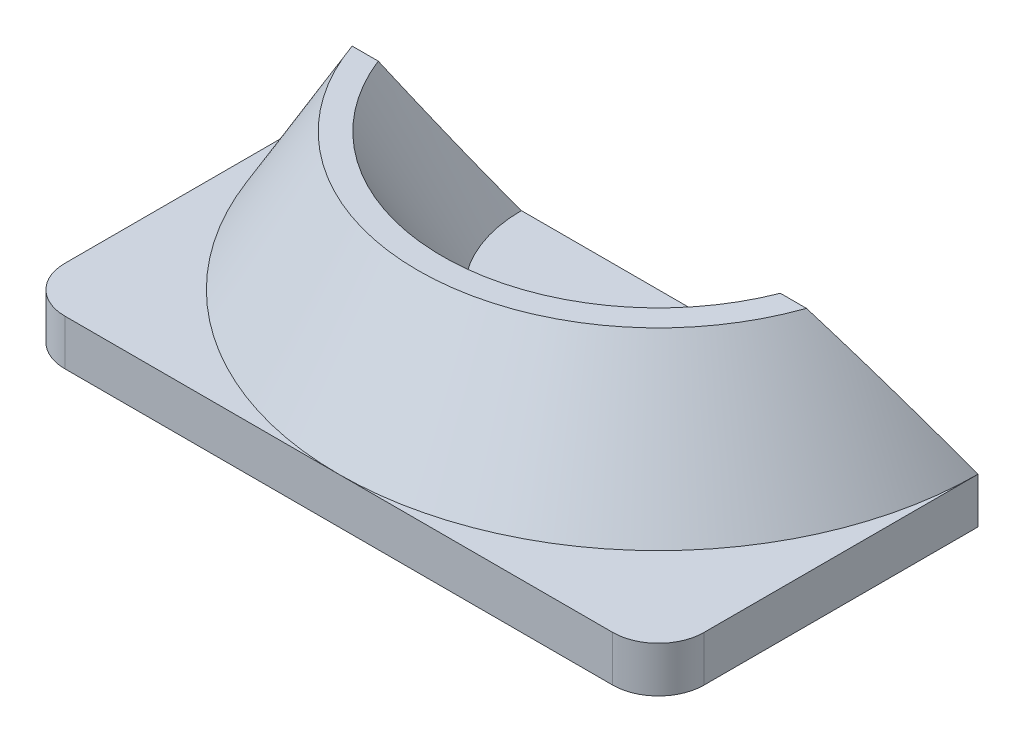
ISO-10303-21;
HEADER;
FILE_DESCRIPTION(('STEP AP214'),'2;1');
FILE_NAME('part.step','',(''),(''),'','','');
FILE_SCHEMA(('AUTOMOTIVE_DESIGN { 1 0 10303 214 1 1 1 1 }'));
ENDSEC;
DATA;
#1=APPLICATION_CONTEXT('core data for automotive mechanical design processes');
#2=APPLICATION_PROTOCOL_DEFINITION('international standard','automotive_design',2000,#1);
#3=PRODUCT_CONTEXT('',#1,'mechanical');
#4=PRODUCT('Part','Part','',(#3));
#5=PRODUCT_RELATED_PRODUCT_CATEGORY('part','',(#4));
#6=PRODUCT_DEFINITION_FORMATION('','',#4);
#7=PRODUCT_DEFINITION_CONTEXT('part definition',#1,'design');
#8=PRODUCT_DEFINITION('design','',#6,#7);
#9=PRODUCT_DEFINITION_SHAPE('','',#8);
#10=(LENGTH_UNIT() NAMED_UNIT(*) SI_UNIT(.MILLI.,.METRE.));
#11=(NAMED_UNIT(*) PLANE_ANGLE_UNIT() SI_UNIT($,.RADIAN.));
#12=(NAMED_UNIT(*) SI_UNIT($,.STERADIAN.) SOLID_ANGLE_UNIT());
#13=UNCERTAINTY_MEASURE_WITH_UNIT(LENGTH_MEASURE(1.E-05),#10,'distance_accuracy_value','');
#14=(GEOMETRIC_REPRESENTATION_CONTEXT(3) GLOBAL_UNCERTAINTY_ASSIGNED_CONTEXT((#13)) GLOBAL_UNIT_ASSIGNED_CONTEXT((#10,
#11,#12)) REPRESENTATION_CONTEXT('',''));
#15=CARTESIAN_POINT('',(0.,0.,0.));
#16=DIRECTION('',(0.,0.,1.));
#17=DIRECTION('',(1.,0.,0.));
#18=AXIS2_PLACEMENT_3D('',#15,#16,#17);
#19=CARTESIAN_POINT('',(-30.,5.,30.));
#20=DIRECTION('',(0.,1.,0.));
#21=DIRECTION('',(0.,0.,1.));
#22=AXIS2_PLACEMENT_3D('',#19,#20,#21);
#23=PLANE('',#22);
#24=CARTESIAN_POINT('',(0.,5.,0.));
#25=DIRECTION('',(0.,1.,0.));
#26=DIRECTION('',(0.,0.,1.));
#27=AXIS2_PLACEMENT_3D('',#24,#25,#26);
#28=CIRCLE('',#27,35.);
#29=CARTESIAN_POINT('',(-35.,5.,0.));
#30=VERTEX_POINT('',#29);
#31=CARTESIAN_POINT('',(0.,5.,35.));
#32=VERTEX_POINT('',#31);
#33=EDGE_CURVE('E49',#30,#32,#28,.T.);
#34=ORIENTED_EDGE('',*,*,#33,.F.);
#35=DIRECTION('',(0.,0.,1.));
#36=VECTOR('',#35,1.);
#37=CARTESIAN_POINT('',(-35.,5.,30.));
#38=LINE('',#37,#36);
#39=CARTESIAN_POINT('',(-35.,5.,30.));
#40=VERTEX_POINT('',#39);
#41=EDGE_CURVE('E200',#30,#40,#38,.T.);
#42=ORIENTED_EDGE('',*,*,#41,.T.);
#43=CARTESIAN_POINT('',(-30.,5.,30.));
#44=DIRECTION('',(0.,1.,0.));
#45=DIRECTION('',(0.,0.,1.));
#46=AXIS2_PLACEMENT_3D('',#43,#44,#45);
#47=CIRCLE('',#46,5.);
#48=CARTESIAN_POINT('',(-30.,5.,35.));
#49=VERTEX_POINT('',#48);
#50=EDGE_CURVE('E268',#40,#49,#47,.T.);
#51=ORIENTED_EDGE('',*,*,#50,.T.);
#52=DIRECTION('',(1.,0.,0.));
#53=VECTOR('',#52,1.);
#54=CARTESIAN_POINT('',(-30.,5.,35.));
#55=LINE('',#54,#53);
#56=EDGE_CURVE('E202',#49,#32,#55,.T.);
#57=ORIENTED_EDGE('',*,*,#56,.T.);
#58=EDGE_LOOP('',(#34,#42,#51,#57));
#59=FACE_BOUND('',#58,.T.);
#60=ADVANCED_FACE('F33',(#59),#23,.T.);
#61=CARTESIAN_POINT('',(35.,5.,0.));
#62=VERTEX_POINT('',#61);
#63=EDGE_CURVE('E11',#32,#62,#28,.T.);
#64=ORIENTED_EDGE('',*,*,#63,.F.);
#65=CARTESIAN_POINT('',(30.,5.,35.));
#66=VERTEX_POINT('',#65);
#67=EDGE_CURVE('E270',#32,#66,#55,.T.);
#68=ORIENTED_EDGE('',*,*,#67,.T.);
#69=CARTESIAN_POINT('',(30.,5.,30.));
#70=DIRECTION('',(0.,1.,0.));
#71=DIRECTION('',(0.,0.,1.));
#72=AXIS2_PLACEMENT_3D('',#69,#70,#71);
#73=CIRCLE('',#72,5.);
#74=CARTESIAN_POINT('',(35.,5.,30.));
#75=VERTEX_POINT('',#74);
#76=EDGE_CURVE('E271',#66,#75,#73,.T.);
#77=ORIENTED_EDGE('',*,*,#76,.T.);
#78=DIRECTION('',(0.,0.,-1.));
#79=VECTOR('',#78,1.);
#80=CARTESIAN_POINT('',(35.,5.,30.));
#81=LINE('',#80,#79);
#82=EDGE_CURVE('E117',#75,#62,#81,.T.);
#83=ORIENTED_EDGE('',*,*,#82,.T.);
#84=EDGE_LOOP('',(#64,#68,#77,#83));
#85=FACE_BOUND('',#84,.T.);
#86=ADVANCED_FACE('F172',(#85),#23,.T.);
#87=CARTESIAN_POINT('',(-30.,5.,30.));
#88=DIRECTION('',(0.,-1.,0.));
#89=DIRECTION('',(0.,0.,-1.));
#90=AXIS2_PLACEMENT_3D('',#87,#88,#89);
#91=CYLINDRICAL_SURFACE('',#90,5.);
#92=CARTESIAN_POINT('',(-30.,0.,30.));
#93=DIRECTION('',(0.,1.,0.));
#94=DIRECTION('',(0.,0.,1.));
#95=AXIS2_PLACEMENT_3D('',#92,#93,#94);
#96=CIRCLE('',#95,5.);
#97=CARTESIAN_POINT('',(-35.,0.,30.));
#98=VERTEX_POINT('',#97);
#99=CARTESIAN_POINT('',(-30.,0.,35.));
#100=VERTEX_POINT('',#99);
#101=EDGE_CURVE('E210',#98,#100,#96,.T.);
#102=ORIENTED_EDGE('',*,*,#101,.T.);
#103=DIRECTION('',(0.,-1.,0.));
#104=VECTOR('',#103,1.);
#105=CARTESIAN_POINT('',(-30.,5.,35.));
#106=LINE('',#105,#104);
#107=EDGE_CURVE('E47',#49,#100,#106,.T.);
#108=ORIENTED_EDGE('',*,*,#107,.F.);
#109=ORIENTED_EDGE('',*,*,#50,.F.);
#110=DIRECTION('',(0.,-1.,0.));
#111=VECTOR('',#110,1.);
#112=CARTESIAN_POINT('',(-35.,5.,30.));
#113=LINE('',#112,#111);
#114=EDGE_CURVE('E228',#40,#98,#113,.T.);
#115=ORIENTED_EDGE('',*,*,#114,.T.);
#116=EDGE_LOOP('',(#102,#108,#109,#115));
#117=FACE_BOUND('',#116,.T.);
#118=ADVANCED_FACE('F35',(#117),#91,.T.);
#119=CARTESIAN_POINT('',(-30.,5.,35.));
#120=DIRECTION('',(0.,0.,-1.));
#121=DIRECTION('',(-1.,0.,0.));
#122=AXIS2_PLACEMENT_3D('',#119,#120,#121);
#123=PLANE('',#122);
#124=DIRECTION('',(1.,0.,0.));
#125=VECTOR('',#124,1.);
#126=CARTESIAN_POINT('',(-30.,0.,35.));
#127=LINE('',#126,#125);
#128=CARTESIAN_POINT('',(30.,0.,35.));
#129=VERTEX_POINT('',#128);
#130=EDGE_CURVE('E251',#100,#129,#127,.T.);
#131=ORIENTED_EDGE('',*,*,#130,.T.);
#132=DIRECTION('',(0.,-1.,0.));
#133=VECTOR('',#132,1.);
#134=CARTESIAN_POINT('',(30.,5.,35.));
#135=LINE('',#134,#133);
#136=EDGE_CURVE('E245',#66,#129,#135,.T.);
#137=ORIENTED_EDGE('',*,*,#136,.F.);
#138=ORIENTED_EDGE('',*,*,#67,.F.);
#139=ORIENTED_EDGE('',*,*,#56,.F.);
#140=ORIENTED_EDGE('',*,*,#107,.T.);
#141=EDGE_LOOP('',(#131,#137,#138,#139,#140));
#142=FACE_BOUND('',#141,.T.);
#143=ADVANCED_FACE('F184',(#142),#123,.F.);
#144=CARTESIAN_POINT('',(30.,5.,30.));
#145=DIRECTION('',(0.,-1.,0.));
#146=DIRECTION('',(0.,0.,-1.));
#147=AXIS2_PLACEMENT_3D('',#144,#145,#146);
#148=CYLINDRICAL_SURFACE('',#147,5.);
#149=CARTESIAN_POINT('',(30.,0.,30.));
#150=DIRECTION('',(0.,1.,0.));
#151=DIRECTION('',(0.,0.,1.));
#152=AXIS2_PLACEMENT_3D('',#149,#150,#151);
#153=CIRCLE('',#152,5.);
#154=CARTESIAN_POINT('',(35.,0.,30.));
#155=VERTEX_POINT('',#154);
#156=EDGE_CURVE('E256',#129,#155,#153,.T.);
#157=ORIENTED_EDGE('',*,*,#156,.T.);
#158=DIRECTION('',(0.,-1.,0.));
#159=VECTOR('',#158,1.);
#160=CARTESIAN_POINT('',(35.,5.,30.));
#161=LINE('',#160,#159);
#162=EDGE_CURVE('E242',#75,#155,#161,.T.);
#163=ORIENTED_EDGE('',*,*,#162,.F.);
#164=ORIENTED_EDGE('',*,*,#76,.F.);
#165=ORIENTED_EDGE('',*,*,#136,.T.);
#166=EDGE_LOOP('',(#157,#163,#164,#165));
#167=FACE_BOUND('',#166,.T.);
#168=ADVANCED_FACE('F181',(#167),#148,.T.);
#169=CARTESIAN_POINT('',(35.,5.,30.));
#170=DIRECTION('',(-1.,0.,0.));
#171=DIRECTION('',(0.,0.,1.));
#172=AXIS2_PLACEMENT_3D('',#169,#170,#171);
#173=PLANE('',#172);
#174=DIRECTION('',(0.,0.,-1.));
#175=VECTOR('',#174,1.);
#176=CARTESIAN_POINT('',(35.,0.,30.));
#177=LINE('',#176,#175);
#178=CARTESIAN_POINT('',(35.,0.,0.));
#179=VERTEX_POINT('',#178);
#180=EDGE_CURVE('E262',#155,#179,#177,.T.);
#181=ORIENTED_EDGE('',*,*,#180,.T.);
#182=DIRECTION('',(0.,-1.,0.));
#183=VECTOR('',#182,1.);
#184=CARTESIAN_POINT('',(35.,5.,0.));
#185=LINE('',#184,#183);
#186=EDGE_CURVE('E240',#62,#179,#185,.T.);
#187=ORIENTED_EDGE('',*,*,#186,.F.);
#188=ORIENTED_EDGE('',*,*,#82,.F.);
#189=ORIENTED_EDGE('',*,*,#162,.T.);
#190=EDGE_LOOP('',(#181,#187,#188,#189));
#191=FACE_BOUND('',#190,.T.);
#192=ADVANCED_FACE('F178',(#191),#173,.F.);
#193=CARTESIAN_POINT('',(-35.,5.,0.));
#194=DIRECTION('',(0.,0.,1.));
#195=DIRECTION('',(1.,0.,0.));
#196=AXIS2_PLACEMENT_3D('',#193,#194,#195);
#197=PLANE('',#196);
#198=DIRECTION('',(-1.,0.,0.));
#199=VECTOR('',#198,1.);
#200=CARTESIAN_POINT('',(-35.,0.,0.));
#201=LINE('',#200,#199);
#202=CARTESIAN_POINT('',(-35.,0.,0.));
#203=VERTEX_POINT('',#202);
#204=EDGE_CURVE('E264',#179,#203,#201,.T.);
#205=ORIENTED_EDGE('',*,*,#204,.T.);
#206=DIRECTION('',(0.,-1.,0.));
#207=VECTOR('',#206,1.);
#208=CARTESIAN_POINT('',(-35.,5.,0.));
#209=LINE('',#208,#207);
#210=EDGE_CURVE('E124',#30,#203,#209,.T.);
#211=ORIENTED_EDGE('',*,*,#210,.F.);
#212=DIRECTION('',(-1.,0.,0.));
#213=VECTOR('',#212,1.);
#214=CARTESIAN_POINT('',(-35.,5.,0.));
#215=LINE('',#214,#213);
#216=CARTESIAN_POINT('',(-15.,5.,0.));
#217=VERTEX_POINT('',#216);
#218=EDGE_CURVE('E121',#217,#30,#215,.T.);
#219=ORIENTED_EDGE('',*,*,#218,.F.);
#220=DIRECTION('',(-1.,0.,0.));
#221=VECTOR('',#220,1.);
#222=CARTESIAN_POINT('',(-35.,5.,0.));
#223=LINE('',#222,#221);
#224=CARTESIAN_POINT('',(15.,5.,0.));
#225=VERTEX_POINT('',#224);
#226=EDGE_CURVE('E110',#225,#217,#223,.T.);
#227=ORIENTED_EDGE('',*,*,#226,.F.);
#228=EDGE_CURVE('E116',#62,#225,#223,.T.);
#229=ORIENTED_EDGE('',*,*,#228,.F.);
#230=ORIENTED_EDGE('',*,*,#186,.T.);
#231=EDGE_LOOP('',(#205,#211,#219,#227,#229,#230));
#232=FACE_BOUND('',#231,.T.);
#233=ADVANCED_FACE('F122',(#232),#197,.F.);
#234=CARTESIAN_POINT('',(-35.,5.,30.));
#235=DIRECTION('',(1.,0.,0.));
#236=DIRECTION('',(0.,0.,-1.));
#237=AXIS2_PLACEMENT_3D('',#234,#235,#236);
#238=PLANE('',#237);
#239=DIRECTION('',(0.,0.,1.));
#240=VECTOR('',#239,1.);
#241=CARTESIAN_POINT('',(-35.,0.,30.));
#242=LINE('',#241,#240);
#243=EDGE_CURVE('E266',#203,#98,#242,.T.);
#244=ORIENTED_EDGE('',*,*,#243,.T.);
#245=ORIENTED_EDGE('',*,*,#114,.F.);
#246=ORIENTED_EDGE('',*,*,#41,.F.);
#247=ORIENTED_EDGE('',*,*,#210,.T.);
#248=EDGE_LOOP('',(#244,#245,#246,#247));
#249=FACE_BOUND('',#248,.T.);
#250=ADVANCED_FACE('F171',(#249),#238,.F.);
#251=CARTESIAN_POINT('',(0.,5.,0.));
#252=DIRECTION('',(0.,-1.,0.));
#253=DIRECTION('',(0.,0.,1.));
#254=AXIS2_PLACEMENT_3D('',#251,#252,#253);
#255=CIRCLE('',#254,15.);
#256=EDGE_CURVE('E55',#225,#217,#255,.T.);
#257=ORIENTED_EDGE('',*,*,#256,.F.);
#258=ORIENTED_EDGE('',*,*,#226,.T.);
#259=EDGE_LOOP('',(#257,#258));
#260=FACE_BOUND('',#259,.T.);
#261=ADVANCED_FACE('F112',(#260),#23,.T.);
#262=CARTESIAN_POINT('',(-30.,0.,30.));
#263=DIRECTION('',(0.,1.,0.));
#264=DIRECTION('',(0.,0.,1.));
#265=AXIS2_PLACEMENT_3D('',#262,#263,#264);
#266=PLANE('',#265);
#267=ORIENTED_EDGE('',*,*,#101,.F.);
#268=ORIENTED_EDGE('',*,*,#243,.F.);
#269=ORIENTED_EDGE('',*,*,#204,.F.);
#270=ORIENTED_EDGE('',*,*,#180,.F.);
#271=ORIENTED_EDGE('',*,*,#156,.F.);
#272=ORIENTED_EDGE('',*,*,#130,.F.);
#273=EDGE_LOOP('',(#267,#268,#269,#270,#271,#272));
#274=FACE_BOUND('',#273,.T.);
#275=ADVANCED_FACE('F163',(#274),#266,.F.);
#276=CARTESIAN_POINT('',(0.,5.,0.));
#277=DIRECTION('',(0.,-1.,0.));
#278=DIRECTION('',(0.,0.,1.));
#279=AXIS2_PLACEMENT_3D('',#276,#277,#278);
#280=CONICAL_SURFACE('',#279,35.,0.5235987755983);
#281=ORIENTED_EDGE('',*,*,#33,.T.);
#282=ORIENTED_EDGE('',*,*,#63,.T.);
#283=CARTESIAN_POINT('',(24.875333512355,20.,8.66025403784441));
#284=CARTESIAN_POINT('',(25.1163008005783,19.703361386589,8.48898965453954));
#285=CARTESIAN_POINT('',(25.3549277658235,19.4053051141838,8.31690678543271));
#286=CARTESIAN_POINT('',(25.8277115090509,18.8065541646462,7.97121776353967));
#287=CARTESIAN_POINT('',(26.0618683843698,18.5058595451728,7.79761164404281));
#288=CARTESIAN_POINT('',(26.7579013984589,17.6001769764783,7.27471556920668));
#289=CARTESIAN_POINT('',(27.2134060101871,16.9915087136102,6.92330078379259));
#290=CARTESIAN_POINT('',(28.1082994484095,15.7665118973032,6.2160485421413));
#291=CARTESIAN_POINT('',(28.5477089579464,15.1501946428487,5.86021760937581));
#292=CARTESIAN_POINT('',(29.4123770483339,13.9101390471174,5.14427117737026));
#293=CARTESIAN_POINT('',(29.837635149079,13.2864004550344,4.78415553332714));
#294=CARTESIAN_POINT('',(30.6749063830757,12.032751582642,4.06036101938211));
#295=CARTESIAN_POINT('',(31.0869265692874,11.4028448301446,3.69668418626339));
#296=CARTESIAN_POINT('',(31.8989753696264,10.1372672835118,2.96600264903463));
#297=CARTESIAN_POINT('',(32.2990039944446,9.50159649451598,2.59899794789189));
#298=CARTESIAN_POINT('',(33.0885099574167,8.22425349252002,1.86152362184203));
#299=CARTESIAN_POINT('',(33.4779721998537,7.58257429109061,1.49104996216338));
#300=CARTESIAN_POINT('',(34.2465474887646,6.29461442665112,0.747445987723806));
#301=CARTESIAN_POINT('',(34.6256609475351,5.64833394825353,0.374315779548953));
#302=CARTESIAN_POINT('',(35.,5.,0.));
#303=B_SPLINE_CURVE_WITH_KNOTS('',3,(#283,#284,#285,#286,#287,#288,#289,#290,#291,#292,#293,
#294,#295,#296,#297,#298,#299,#300,#301,#302),.UNSPECIFIED.,.F.,.F.,(4,2,2,2,2,2,2,2,2,4),(0.,
1.25636911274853,2.51271083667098,5.02504910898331,7.53403673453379,10.0431093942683,
12.5508223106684,15.0585329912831,17.5696554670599,20.0806777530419),.UNSPECIFIED.);
#304=CARTESIAN_POINT('',(24.875333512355,20.,8.66025403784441));
#305=VERTEX_POINT('',#304);
#306=EDGE_CURVE('E146',#305,#62,#303,.T.);
#307=ORIENTED_EDGE('',*,*,#306,.F.);
#308=CARTESIAN_POINT('',(0.,20.,0.));
#309=DIRECTION('',(0.,1.,0.));
#310=DIRECTION('',(0.,0.,1.));
#311=AXIS2_PLACEMENT_3D('',#308,#309,#310);
#312=CIRCLE('',#311,26.3397459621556);
#313=CARTESIAN_POINT('',(-24.875333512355,20.,8.66025403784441));
#314=VERTEX_POINT('',#313);
#315=EDGE_CURVE('E130',#314,#305,#312,.T.);
#316=ORIENTED_EDGE('',*,*,#315,.F.);
#317=CARTESIAN_POINT('',(-24.875333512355,20.,8.66025403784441));
#318=CARTESIAN_POINT('',(-25.1163008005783,19.703361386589,8.48898965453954));
#319=CARTESIAN_POINT('',(-25.3549277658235,19.4053051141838,8.3169067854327));
#320=CARTESIAN_POINT('',(-25.8277115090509,18.8065541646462,7.97121776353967));
#321=CARTESIAN_POINT('',(-26.0618683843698,18.5058595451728,7.79761164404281));
#322=CARTESIAN_POINT('',(-26.7579013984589,17.6001769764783,7.27471556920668));
#323=CARTESIAN_POINT('',(-27.2134060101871,16.9915087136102,6.92330078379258));
#324=CARTESIAN_POINT('',(-28.1082994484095,15.7665118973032,6.2160485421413));
#325=CARTESIAN_POINT('',(-28.5477089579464,15.1501946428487,5.86021760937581));
#326=CARTESIAN_POINT('',(-29.4123770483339,13.9101390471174,5.14427117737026));
#327=CARTESIAN_POINT('',(-29.837635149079,13.2864004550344,4.78415553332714));
#328=CARTESIAN_POINT('',(-30.6749063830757,12.032751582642,4.06036101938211));
#329=CARTESIAN_POINT('',(-31.0869265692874,11.4028448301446,3.69668418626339));
#330=CARTESIAN_POINT('',(-31.8989753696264,10.1372672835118,2.96600264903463));
#331=CARTESIAN_POINT('',(-32.2990039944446,9.50159649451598,2.59899794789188));
#332=CARTESIAN_POINT('',(-33.0885099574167,8.22425349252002,1.86152362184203));
#333=CARTESIAN_POINT('',(-33.4779721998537,7.58257429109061,1.49104996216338));
#334=CARTESIAN_POINT('',(-34.2465474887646,6.29461442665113,0.747445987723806));
#335=CARTESIAN_POINT('',(-34.6256609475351,5.64833394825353,0.374315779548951));
#336=CARTESIAN_POINT('',(-35.,5.,0.));
#337=B_SPLINE_CURVE_WITH_KNOTS('',3,(#317,#318,#319,#320,#321,#322,#323,#324,#325,#326,#327,
#328,#329,#330,#331,#332,#333,#334,#335,#336),.UNSPECIFIED.,.F.,.F.,(4,2,2,2,2,2,2,2,2,4),(0.,
1.25636911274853,2.51271083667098,5.02504910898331,7.53403673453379,10.0431093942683,
12.5508223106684,15.0585329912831,17.5696554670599,20.0806777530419),.UNSPECIFIED.);
#338=EDGE_CURVE('E144',#314,#30,#337,.T.);
#339=ORIENTED_EDGE('',*,*,#338,.T.);
#340=EDGE_LOOP('',(#281,#282,#307,#316,#339));
#341=FACE_BOUND('',#340,.T.);
#342=ADVANCED_FACE('F167',(#341),#280,.T.);
#343=CARTESIAN_POINT('',(35.,5.,0.));
#344=DIRECTION('',(0.,0.500000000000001,-0.866025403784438));
#345=DIRECTION('',(0.,0.866025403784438,0.500000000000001));
#346=AXIS2_PLACEMENT_3D('',#343,#344,#345);
#347=PLANE('',#346);
#348=ORIENTED_EDGE('',*,*,#228,.T.);
#349=CARTESIAN_POINT('',(22.0183473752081,20.,8.66025403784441));
#350=CARTESIAN_POINT('',(21.7670216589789,19.3610803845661,8.29137362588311));
#351=CARTESIAN_POINT('',(21.5118821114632,18.7232756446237,7.92313688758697));
#352=CARTESIAN_POINT('',(20.9931402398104,17.4502326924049,7.18814519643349));
#353=CARTESIAN_POINT('',(20.7295376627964,16.8149945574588,6.82139028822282));
#354=CARTESIAN_POINT('',(20.1933411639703,15.5481488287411,6.08997656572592));
#355=CARTESIAN_POINT('',(19.9207573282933,14.9165380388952,5.72531590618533));
#356=CARTESIAN_POINT('',(19.3653207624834,13.6567026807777,4.99794962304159));
#357=CARTESIAN_POINT('',(19.0824679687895,13.0284781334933,4.63524401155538));
#358=CARTESIAN_POINT('',(18.5051268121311,11.7755703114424,3.9118773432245));
#359=CARTESIAN_POINT('',(18.2106310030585,11.1508896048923,3.55121776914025));
#360=CARTESIAN_POINT('',(17.6087694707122,9.90621820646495,2.83260640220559));
#361=CARTESIAN_POINT('',(17.3014042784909,9.28622732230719,2.47465449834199));
#362=CARTESIAN_POINT('',(16.6717334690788,8.05114658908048,1.76158030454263));
#363=CARTESIAN_POINT('',(16.3494122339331,7.43606268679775,1.40646144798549));
#364=CARTESIAN_POINT('',(15.8533399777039,6.51849342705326,0.876702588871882));
#365=CARTESIAN_POINT('',(15.6858706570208,6.2134562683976,0.700589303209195));
#366=CARTESIAN_POINT('',(15.3464088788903,5.60526558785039,0.349450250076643));
#367=CARTESIAN_POINT('',(15.1744162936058,5.30211211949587,0.174424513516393));
#368=CARTESIAN_POINT('',(15.,5.,0.));
#369=B_SPLINE_CURVE_WITH_KNOTS('',3,(#349,#350,#351,#352,#353,#354,#355,#356,#357,#358,#359,
#360,#361,#362,#363,#364,#365,#366,#367,#368),.UNSPECIFIED.,.F.,.F.,(4,2,2,2,2,2,2,2,2,4),(0.,
2.33818948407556,4.6764488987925,7.01216636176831,9.3478982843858,11.685148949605,
14.0223032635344,16.3619556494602,17.5319636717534,18.7020047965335),.UNSPECIFIED.);
#370=CARTESIAN_POINT('',(22.0183473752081,20.,8.66025403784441));
#371=VERTEX_POINT('',#370);
#372=EDGE_CURVE('E140',#371,#225,#369,.T.);
#373=ORIENTED_EDGE('',*,*,#372,.F.);
#374=DIRECTION('',(1.,0.,0.));
#375=VECTOR('',#374,1.);
#376=CARTESIAN_POINT('',(35.,20.,8.66025403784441));
#377=LINE('',#376,#375);
#378=EDGE_CURVE('E281',#305,#371,#377,.F.);
#379=ORIENTED_EDGE('',*,*,#378,.F.);
#380=ORIENTED_EDGE('',*,*,#306,.T.);
#381=EDGE_LOOP('',(#348,#373,#379,#380));
#382=FACE_BOUND('',#381,.T.);
#383=ADVANCED_FACE('F162',(#382),#347,.T.);
#384=CARTESIAN_POINT('',(0.,5.,0.));
#385=DIRECTION('',(0.,1.,0.));
#386=DIRECTION('',(0.,0.,1.));
#387=AXIS2_PLACEMENT_3D('',#384,#385,#386);
#388=CONICAL_SURFACE('',#387,15.,0.5235987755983);
#389=ORIENTED_EDGE('',*,*,#256,.T.);
#390=CARTESIAN_POINT('',(-22.0183473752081,20.,8.66025403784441));
#391=CARTESIAN_POINT('',(-21.7670216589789,19.3610803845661,8.29137362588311));
#392=CARTESIAN_POINT('',(-21.5118821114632,18.7232756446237,7.92313688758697));
#393=CARTESIAN_POINT('',(-20.9931402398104,17.4502326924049,7.18814519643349));
#394=CARTESIAN_POINT('',(-20.7295376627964,16.8149945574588,6.82139028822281));
#395=CARTESIAN_POINT('',(-20.1933411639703,15.5481488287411,6.08997656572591));
#396=CARTESIAN_POINT('',(-19.9207573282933,14.9165380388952,5.72531590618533));
#397=CARTESIAN_POINT('',(-19.3653207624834,13.6567026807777,4.99794962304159));
#398=CARTESIAN_POINT('',(-19.0824679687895,13.0284781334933,4.63524401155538));
#399=CARTESIAN_POINT('',(-18.5051268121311,11.7755703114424,3.9118773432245));
#400=CARTESIAN_POINT('',(-18.2106310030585,11.1508896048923,3.55121776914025));
#401=CARTESIAN_POINT('',(-17.6087694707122,9.90621820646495,2.83260640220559));
#402=CARTESIAN_POINT('',(-17.3014042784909,9.28622732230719,2.47465449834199));
#403=CARTESIAN_POINT('',(-16.6717334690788,8.05114658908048,1.76158030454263));
#404=CARTESIAN_POINT('',(-16.3494122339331,7.43606268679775,1.40646144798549));
#405=CARTESIAN_POINT('',(-15.8533399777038,6.51849342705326,0.876702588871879));
#406=CARTESIAN_POINT('',(-15.6858706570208,6.21345626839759,0.700589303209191));
#407=CARTESIAN_POINT('',(-15.3464088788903,5.60526558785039,0.34945025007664));
#408=CARTESIAN_POINT('',(-15.1744162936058,5.30211211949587,0.174424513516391));
#409=CARTESIAN_POINT('',(-15.,5.,0.));
#410=B_SPLINE_CURVE_WITH_KNOTS('',3,(#390,#391,#392,#393,#394,#395,#396,#397,#398,#399,#400,
#401,#402,#403,#404,#405,#406,#407,#408,#409),.UNSPECIFIED.,.F.,.F.,(4,2,2,2,2,2,2,2,2,4),(0.,
2.33818948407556,4.6764488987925,7.0121663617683,9.3478982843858,11.685148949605,
14.0223032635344,16.3619556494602,17.5319636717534,18.7020047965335),.UNSPECIFIED.);
#411=CARTESIAN_POINT('',(-22.0183473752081,20.,8.66025403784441));
#412=VERTEX_POINT('',#411);
#413=EDGE_CURVE('E137',#412,#217,#410,.T.);
#414=ORIENTED_EDGE('',*,*,#413,.F.);
#415=CARTESIAN_POINT('',(0.,20.,0.));
#416=DIRECTION('',(0.,1.,0.));
#417=DIRECTION('',(0.,0.,1.));
#418=AXIS2_PLACEMENT_3D('',#415,#416,#417);
#419=CIRCLE('',#418,23.6602540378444);
#420=EDGE_CURVE('E279',#371,#412,#419,.F.);
#421=ORIENTED_EDGE('',*,*,#420,.F.);
#422=ORIENTED_EDGE('',*,*,#372,.T.);
#423=EDGE_LOOP('',(#389,#414,#421,#422));
#424=FACE_BOUND('',#423,.T.);
#425=ADVANCED_FACE('F135',(#424),#388,.F.);
#426=CARTESIAN_POINT('',(-35.,5.,0.));
#427=DIRECTION('',(0.,0.500000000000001,-0.866025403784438));
#428=DIRECTION('',(0.,0.866025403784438,0.500000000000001));
#429=AXIS2_PLACEMENT_3D('',#426,#427,#428);
#430=PLANE('',#429);
#431=ORIENTED_EDGE('',*,*,#218,.T.);
#432=ORIENTED_EDGE('',*,*,#338,.F.);
#433=DIRECTION('',(1.,0.,0.));
#434=VECTOR('',#433,1.);
#435=CARTESIAN_POINT('',(-35.,20.,8.66025403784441));
#436=LINE('',#435,#434);
#437=EDGE_CURVE('E143',#412,#314,#436,.F.);
#438=ORIENTED_EDGE('',*,*,#437,.F.);
#439=ORIENTED_EDGE('',*,*,#413,.T.);
#440=EDGE_LOOP('',(#431,#432,#438,#439));
#441=FACE_BOUND('',#440,.T.);
#442=ADVANCED_FACE('F142',(#441),#430,.T.);
#443=CARTESIAN_POINT('',(0.,20.,0.));
#444=DIRECTION('',(0.,1.,0.));
#445=DIRECTION('',(0.,0.,1.));
#446=AXIS2_PLACEMENT_3D('',#443,#444,#445);
#447=PLANE('',#446);
#448=ORIENTED_EDGE('',*,*,#315,.T.);
#449=ORIENTED_EDGE('',*,*,#378,.T.);
#450=ORIENTED_EDGE('',*,*,#420,.T.);
#451=ORIENTED_EDGE('',*,*,#437,.T.);
#452=EDGE_LOOP('',(#448,#449,#450,#451));
#453=FACE_BOUND('',#452,.T.);
#454=ADVANCED_FACE('F285',(#453),#447,.T.);
#455=CLOSED_SHELL('',(#60,#86,#118,#143,#168,#192,#233,#250,#261,#275,#342,#383,#425,#442,#454));
#456=MANIFOLD_SOLID_BREP('B2',#455);
#457=ADVANCED_BREP_SHAPE_REPRESENTATION('',(#18,#456),#14);
#458=SHAPE_DEFINITION_REPRESENTATION(#9,#457);
ENDSEC;
END-ISO-10303-21;
